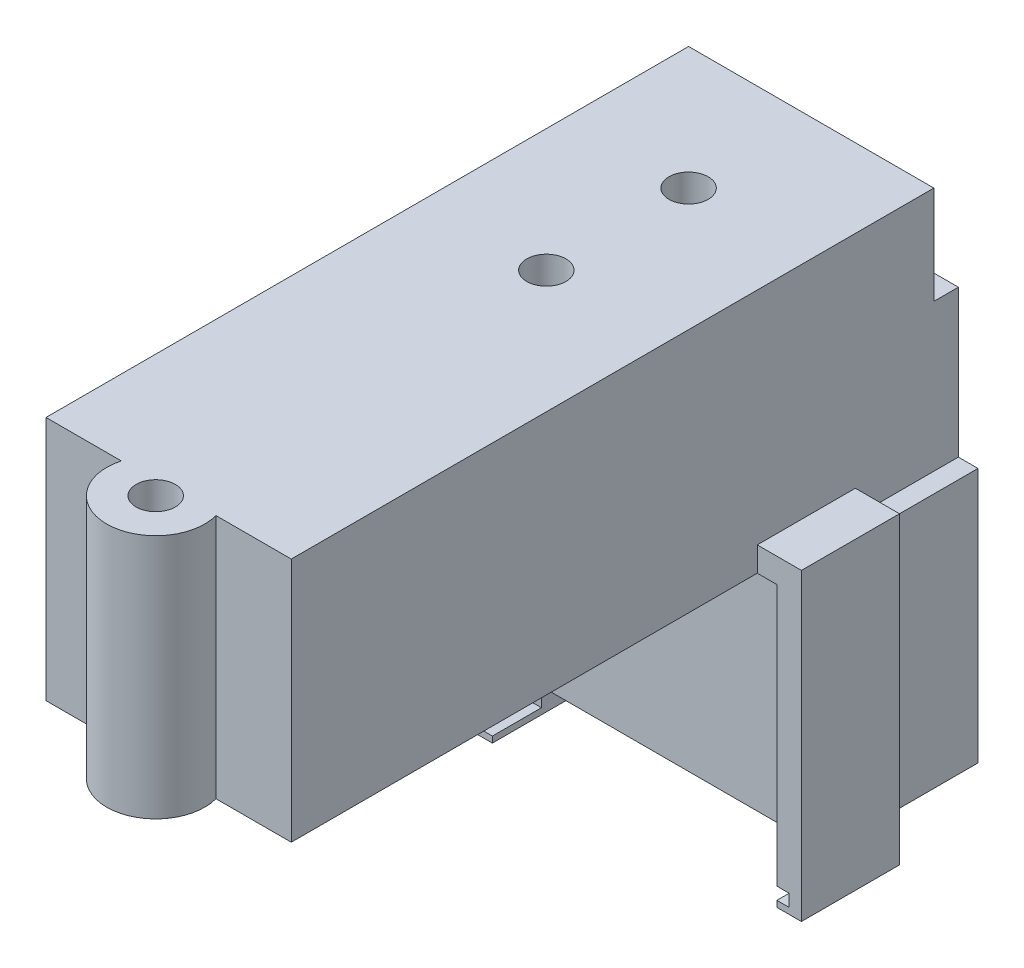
from build123d import *

# Parameters (mm, degrees)
SKETCH1_W                 = 50
SKETCH1_H                 = 80
SKETCH1_R                 = 4
BOSS_EXTRUDE1_DEPTH       = 50
BOSS_EXTRUDE2_START       = -40
SKETCH1_3_R               = 4
BOSS_EXTRUDE2_DEPTH       = 40
SKETCH2_W                 = 5
SKETCH2_H                 = 20
CUT_EXTRUDE2_DEPTH        = 107.77078252
SKETCH1_4_R               = 4
BOSS_EXTRUDE4_DEPTH       = 10
SKETCH1_5_R               = 4
CUT_EXTRUDE4_DEPTH        = 107.77078252
BOSS_EXTRUDE5_DEPTH       = 29
BOSS_EXTRUDE5_DEPTH_BACK  = 29
BOSS_EXTRUDE5_START       = -25
SKETCH3_W                 = 31
SKETCH3_H                 = 52
SKETCH8_R                 = 7.5
CUT_EXTRUDE5_DEPTH        = 25
BOSS_EXTRUDE12_DEPTH      = 10
BOSS_EXTRUDE12_DEPTH_BACK = 10
SKETCH12_W                = 2.5
SKETCH12_H                = 2.5
BOSS_EXTRUDE13_DEPTH      = 10
SKETCH13_R                = 4
BOSS_EXTRUDE14_DEPTH      = 50
BOSS_EXTRUDE15_DEPTH      = 10


with BuildPart() as part:
    # Sketch1 → Boss-Extrude1 (new body)
    with BuildSketch(Plane(origin=(0, 0, 0), x_dir=(1, 0, 0), z_dir=(0, 1, 0))):
        with Locations((25, 40)):
            Rectangle(SKETCH1_W, SKETCH1_H)
        with Locations(Location((25, 50, 0), (0, 0, 270))):
            Circle(SKETCH1_R, mode=Mode.SUBTRACT)
        with Locations(Location((25, 21, 0), (0, 0, 270))):
            Circle(SKETCH1_R, mode=Mode.SUBTRACT)
    extrude(amount=BOSS_EXTRUDE1_DEPTH)

    # Sketch1_3 → Boss-Extrude2 (add)
    with BuildSketch(Plane(origin=(0, 0, 0), x_dir=(1, 0, 0), z_dir=(0, 1, 0)).offset(BOSS_EXTRUDE2_START)):
        with Locations(Location((25, 21, 0), (0, 0, 270))):
            Circle(SKETCH1_3_R)
    extrude(amount=BOSS_EXTRUDE2_DEPTH)


with BuildPart() as boss_extrude2_kept_piece:
    # of the separate pieces the step leaves, the one the design keeps (boss_extrude2_pieces_kept)
    add(part.part.solids().sort_by_distance((0, 0, -80))[0])

    # Sketch2 → Cut-Extrude2 (cut, through all)
    with BuildSketch(Plane.ZY):
        with Locations((-77.5, 40)):
            Rectangle(SKETCH2_W, SKETCH2_H)
    extrude(amount=-CUT_EXTRUDE2_DEPTH, mode=Mode.SUBTRACT)

    # Sketch1_4 → Boss-Extrude4 (add)
    with BuildSketch(Plane(origin=(0, 0, 0), x_dir=(1, 0, 0), z_dir=(0, 1, 0))):
        with Locations(Location((25, 21, 0), (0, 0, 270))):
            Circle(SKETCH1_4_R)
        with Locations(Location((25, 50, 0), (0, 0, 270))):
            Circle(SKETCH1_4_R)
    extrude(amount=BOSS_EXTRUDE4_DEPTH)

    # Sketch1_5 → Cut-Extrude4 (cut, through all)
    with BuildSketch(Plane(origin=(0, 0, 0), x_dir=(1, 0, 0), z_dir=(0, 1, 0))):
        with Locations(Location((25, 21, 0), (0, 0, 270))):
            Circle(SKETCH1_5_R)
    extrude(amount=CUT_EXTRUDE4_DEPTH, mode=Mode.SUBTRACT)

    # Sketch3 → Boss-Extrude5 (add, two sides: drawn at the far end of the back side and taken through both)
    with BuildSketch(Plane(origin=(50, 0, 0), x_dir=(0, 0, -1), z_dir=(1, 0, 0)).offset(BOSS_EXTRUDE5_START - BOSS_EXTRUDE5_DEPTH_BACK)):
        with Locations((64.5, -26)):
            Rectangle(SKETCH3_W, SKETCH3_H)
    extrude(amount=BOSS_EXTRUDE5_DEPTH + BOSS_EXTRUDE5_DEPTH_BACK)

    # Sketch8 → Cut-Extrude5 (cut)
    with BuildSketch(Plane.XZ):
        with Locations(Location((25, -21, 0), (0, 0, 270))):
            Circle(SKETCH8_R)
    extrude(amount=-CUT_EXTRUDE5_DEPTH, mode=Mode.SUBTRACT)

    # Sketch11 → Boss-Extrude12 (add, two sides: drawn at the far end of the back side and taken through both)
    with BuildSketch(Plane.XY.offset(-49).offset(-BOSS_EXTRUDE12_DEPTH_BACK)):
        Polygon((50, 5), (50, 0), (54, 0), (54, -53.250080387), (56.5, -53.250080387), (56.5, -55.750080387), (53.999678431, -55.750080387), (53.999678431, -57), (59, -57), (59, 5), align=None)
        Polygon((-9, -57), (-4, -57), (-4, -55.75), (-6.5, -55.75), (-6.5, -53.25), (-4, -53.25), (-4, 0), (0, 0), (0, 5), (-9, 5), align=None)
    extrude(amount=BOSS_EXTRUDE12_DEPTH + BOSS_EXTRUDE12_DEPTH_BACK)

    # Sketch12 → Boss-Extrude13 (add)
    with BuildSketch(Plane.XY.offset(-49)):
        with Locations((-5.25, -54.5)):
            Rectangle(SKETCH12_W, SKETCH12_H)
        with Locations((55.25, -54.500080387)):
            Rectangle(SKETCH12_W, SKETCH12_H)
    extrude(amount=-BOSS_EXTRUDE13_DEPTH)

    # Sketch13 → Boss-Extrude14 (add, through all)
    with BuildSketch(Plane.XZ):
        with BuildLine():
            Line((0, 56), (0, 0))
            Line((0, 0), (50, 0))
            Line((50, 0), (50, 56))
            Line((50, 56), (34.647958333, 56))
            ThreePointArc((34.647958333, 56), (25, 68.63), (15.352041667, 56))
            Line((15.352041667, 56), (0, 56))
        make_face()
        with Locations(Location((25, 58.63, 0), (0, 0, 270))):
            Circle(SKETCH13_R, mode=Mode.SUBTRACT)
    extrude(amount=-BOSS_EXTRUDE14_DEPTH)

    # Sketch13_3 → Boss-Extrude15 (add)
    with BuildSketch(Plane.XZ):
        with BuildLine():
            ThreePointArc((29, 58.63), (23.595591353, 62.375348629), (21.986181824, 56))
            Line((21.986181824, 56), (28.013818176, 56))
            ThreePointArc((28.013818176, 56), (28.745348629, 57.225591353), (29, 58.63))
        make_face()
        with BuildLine():
            Line((28.013818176, 56), (21.986181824, 56))
            ThreePointArc((21.986181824, 56), (25, 54.63), (28.013818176, 56))
        make_face()
        with BuildLine():
            ThreePointArc((29, 58.63), (23.595591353, 62.375348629), (21.986181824, 56))
            Line((21.986181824, 56), (28.013818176, 56))
            ThreePointArc((28.013818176, 56), (28.745348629, 57.225591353), (29, 58.63))
        make_face()
        with BuildLine():
            Line((28.013818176, 56), (21.986181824, 56))
            ThreePointArc((21.986181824, 56), (25, 54.63), (28.013818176, 56))
        make_face()
    extrude(amount=-BOSS_EXTRUDE15_DEPTH)


solid = boss_extrude2_kept_piece.part
